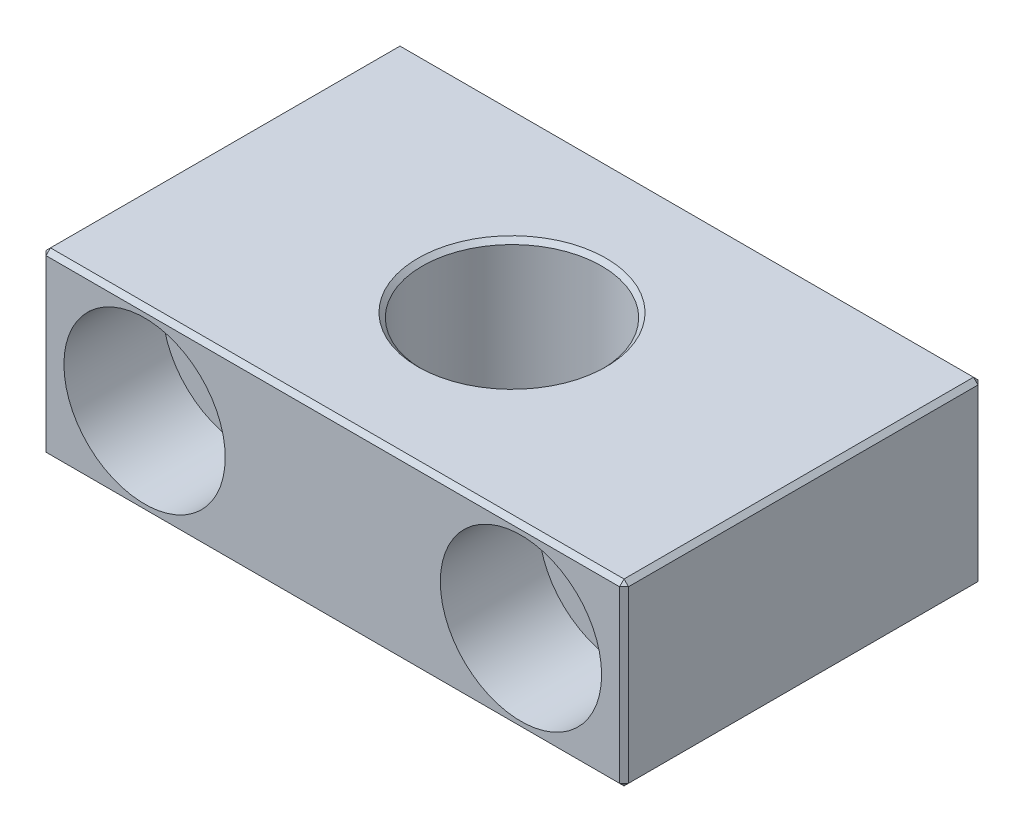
ISO-10303-21;
HEADER;
FILE_DESCRIPTION(('STEP AP214'),'2;1');
FILE_NAME('part.step','',(''),(''),'','','');
FILE_SCHEMA(('AUTOMOTIVE_DESIGN { 1 0 10303 214 1 1 1 1 }'));
ENDSEC;
DATA;
#1=APPLICATION_CONTEXT('core data for automotive mechanical design processes');
#2=APPLICATION_PROTOCOL_DEFINITION('international standard','automotive_design',2000,#1);
#3=PRODUCT_CONTEXT('',#1,'mechanical');
#4=PRODUCT('Part','Part','',(#3));
#5=PRODUCT_RELATED_PRODUCT_CATEGORY('part','',(#4));
#6=PRODUCT_DEFINITION_FORMATION('','',#4);
#7=PRODUCT_DEFINITION_CONTEXT('part definition',#1,'design');
#8=PRODUCT_DEFINITION('design','',#6,#7);
#9=PRODUCT_DEFINITION_SHAPE('','',#8);
#10=(LENGTH_UNIT() NAMED_UNIT(*) SI_UNIT(.MILLI.,.METRE.));
#11=(NAMED_UNIT(*) PLANE_ANGLE_UNIT() SI_UNIT($,.RADIAN.));
#12=(NAMED_UNIT(*) SI_UNIT($,.STERADIAN.) SOLID_ANGLE_UNIT());
#13=UNCERTAINTY_MEASURE_WITH_UNIT(LENGTH_MEASURE(1.E-05),#10,'distance_accuracy_value','');
#14=(GEOMETRIC_REPRESENTATION_CONTEXT(3) GLOBAL_UNCERTAINTY_ASSIGNED_CONTEXT((#13)) GLOBAL_UNIT_ASSIGNED_CONTEXT((#10,
#11,#12)) REPRESENTATION_CONTEXT('',''));
#15=CARTESIAN_POINT('',(0.,0.,0.));
#16=DIRECTION('',(0.,0.,1.));
#17=DIRECTION('',(1.,0.,0.));
#18=AXIS2_PLACEMENT_3D('',#15,#16,#17);
#19=CARTESIAN_POINT('',(32.5,10.0000000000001,40.0000000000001));
#20=DIRECTION('',(-1.,0.,0.));
#21=DIRECTION('',(0.,-1.,0.));
#22=AXIS2_PLACEMENT_3D('',#19,#20,#21);
#23=PLANE('',#22);
#24=DIRECTION('',(0.,0.,1.));
#25=VECTOR('',#24,1.);
#26=CARTESIAN_POINT('',(32.5,9.50000000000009,40.0000000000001));
#27=LINE('',#26,#25);
#28=CARTESIAN_POINT('',(32.5,9.50000000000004,0.500000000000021));
#29=VERTEX_POINT('',#28);
#30=CARTESIAN_POINT('',(32.5,9.50000000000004,39.5000000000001));
#31=VERTEX_POINT('',#30);
#32=EDGE_CURVE('E196',#29,#31,#27,.T.);
#33=ORIENTED_EDGE('',*,*,#32,.T.);
#34=DIRECTION('',(0.,-1.,0.));
#35=VECTOR('',#34,1.);
#36=CARTESIAN_POINT('',(32.5,-9.99999999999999,39.5000000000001));
#37=LINE('',#36,#35);
#38=CARTESIAN_POINT('',(32.5,-9.49999999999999,39.5000000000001));
#39=VERTEX_POINT('',#38);
#40=EDGE_CURVE('E198',#31,#39,#37,.T.);
#41=ORIENTED_EDGE('',*,*,#40,.T.);
#42=DIRECTION('',(0.,0.,-1.));
#43=VECTOR('',#42,1.);
#44=CARTESIAN_POINT('',(32.5,-9.50000000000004,40.0000000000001));
#45=LINE('',#44,#43);
#46=CARTESIAN_POINT('',(32.5,-9.5,0.5));
#47=VERTEX_POINT('',#46);
#48=EDGE_CURVE('E192',#39,#47,#45,.T.);
#49=ORIENTED_EDGE('',*,*,#48,.T.);
#50=DIRECTION('',(0.,1.,0.));
#51=VECTOR('',#50,1.);
#52=CARTESIAN_POINT('',(32.5,10.,0.500000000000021));
#53=LINE('',#52,#51);
#54=EDGE_CURVE('E194',#47,#29,#53,.T.);
#55=ORIENTED_EDGE('',*,*,#54,.T.);
#56=EDGE_LOOP('',(#33,#41,#49,#55));
#57=FACE_BOUND('',#56,.T.);
#58=ADVANCED_FACE('F38',(#57),#23,.F.);
#59=CARTESIAN_POINT('',(-32.5,10.,40.0000000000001));
#60=DIRECTION('',(0.,-1.,0.));
#61=DIRECTION('',(0.,0.,-1.));
#62=AXIS2_PLACEMENT_3D('',#59,#60,#61);
#63=PLANE('',#62);
#64=CARTESIAN_POINT('',(0.,10.,20.));
#65=DIRECTION('',(0.,-1.,0.));
#66=DIRECTION('',(0.,0.,-1.));
#67=AXIS2_PLACEMENT_3D('',#64,#65,#66);
#68=CIRCLE('',#67,10.5);
#69=CARTESIAN_POINT('',(0.,10.,9.49999999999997));
#70=VERTEX_POINT('',#69);
#71=EDGE_CURVE('E173',#70,#70,#68,.T.);
#72=ORIENTED_EDGE('',*,*,#71,.T.);
#73=EDGE_LOOP('',(#72));
#74=FACE_BOUND('',#73,.T.);
#75=DIRECTION('',(1.,0.,0.));
#76=VECTOR('',#75,1.);
#77=CARTESIAN_POINT('',(32.5,10.,39.5000000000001));
#78=LINE('',#77,#76);
#79=CARTESIAN_POINT('',(-32.,10.,39.5000000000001));
#80=VERTEX_POINT('',#79);
#81=CARTESIAN_POINT('',(32.,10.,39.5000000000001));
#82=VERTEX_POINT('',#81);
#83=EDGE_CURVE('E137',#80,#82,#78,.T.);
#84=ORIENTED_EDGE('',*,*,#83,.T.);
#85=DIRECTION('',(0.,0.,-1.));
#86=VECTOR('',#85,1.);
#87=CARTESIAN_POINT('',(32.,10.0000000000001,40.0000000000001));
#88=LINE('',#87,#86);
#89=CARTESIAN_POINT('',(32.,10.,0.5));
#90=VERTEX_POINT('',#89);
#91=EDGE_CURVE('E133',#82,#90,#88,.T.);
#92=ORIENTED_EDGE('',*,*,#91,.T.);
#93=DIRECTION('',(-1.,0.,0.));
#94=VECTOR('',#93,1.);
#95=CARTESIAN_POINT('',(-32.5,10.,0.500000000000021));
#96=LINE('',#95,#94);
#97=CARTESIAN_POINT('',(-32.,10.,0.49999999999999));
#98=VERTEX_POINT('',#97);
#99=EDGE_CURVE('E125',#90,#98,#96,.T.);
#100=ORIENTED_EDGE('',*,*,#99,.T.);
#101=DIRECTION('',(0.,0.,1.));
#102=VECTOR('',#101,1.);
#103=CARTESIAN_POINT('',(-32.,10.,40.0000000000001));
#104=LINE('',#103,#102);
#105=EDGE_CURVE('E130',#98,#80,#104,.T.);
#106=ORIENTED_EDGE('',*,*,#105,.T.);
#107=EDGE_LOOP('',(#84,#92,#100,#106));
#108=FACE_BOUND('',#107,.T.);
#109=ADVANCED_FACE('F128',(#74,#108),#63,.F.);
#110=CARTESIAN_POINT('',(-32.5,10.,40.0000000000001));
#111=DIRECTION('',(1.,0.,0.));
#112=DIRECTION('',(0.,1.,0.));
#113=AXIS2_PLACEMENT_3D('',#110,#111,#112);
#114=PLANE('',#113);
#115=DIRECTION('',(0.,1.,0.));
#116=VECTOR('',#115,1.);
#117=CARTESIAN_POINT('',(-32.5,10.,39.5000000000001));
#118=LINE('',#117,#116);
#119=CARTESIAN_POINT('',(-32.5,-9.5,39.5000000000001));
#120=VERTEX_POINT('',#119);
#121=CARTESIAN_POINT('',(-32.5,9.50000000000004,39.5000000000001));
#122=VERTEX_POINT('',#121);
#123=EDGE_CURVE('E205',#120,#122,#118,.T.);
#124=ORIENTED_EDGE('',*,*,#123,.T.);
#125=DIRECTION('',(0.,0.,-1.));
#126=VECTOR('',#125,1.);
#127=CARTESIAN_POINT('',(-32.5,9.50000000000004,40.0000000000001));
#128=LINE('',#127,#126);
#129=CARTESIAN_POINT('',(-32.5,9.5,0.500000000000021));
#130=VERTEX_POINT('',#129);
#131=EDGE_CURVE('E207',#122,#130,#128,.T.);
#132=ORIENTED_EDGE('',*,*,#131,.T.);
#133=DIRECTION('',(0.,-1.,0.));
#134=VECTOR('',#133,1.);
#135=CARTESIAN_POINT('',(-32.5,10.,0.500000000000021));
#136=LINE('',#135,#134);
#137=CARTESIAN_POINT('',(-32.5,-9.50000000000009,0.5));
#138=VERTEX_POINT('',#137);
#139=EDGE_CURVE('E203',#130,#138,#136,.T.);
#140=ORIENTED_EDGE('',*,*,#139,.T.);
#141=DIRECTION('',(0.,0.,1.));
#142=VECTOR('',#141,1.);
#143=CARTESIAN_POINT('',(-32.5,-9.50000000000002,40.0000000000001));
#144=LINE('',#143,#142);
#145=EDGE_CURVE('E201',#138,#120,#144,.T.);
#146=ORIENTED_EDGE('',*,*,#145,.T.);
#147=EDGE_LOOP('',(#124,#132,#140,#146));
#148=FACE_BOUND('',#147,.T.);
#149=ADVANCED_FACE('F314',(#148),#114,.F.);
#150=CARTESIAN_POINT('',(-32.5,-10.,40.0000000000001));
#151=DIRECTION('',(0.,1.,0.));
#152=DIRECTION('',(0.,0.,1.));
#153=AXIS2_PLACEMENT_3D('',#150,#151,#152);
#154=PLANE('',#153);
#155=DIRECTION('',(-1.,0.,0.));
#156=VECTOR('',#155,1.);
#157=CARTESIAN_POINT('',(-32.5,-10.,39.5000000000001));
#158=LINE('',#157,#156);
#159=CARTESIAN_POINT('',(32.,-9.99999999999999,39.5000000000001));
#160=VERTEX_POINT('',#159);
#161=CARTESIAN_POINT('',(-32.,-10.,39.5000000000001));
#162=VERTEX_POINT('',#161);
#163=EDGE_CURVE('E47',#160,#162,#158,.T.);
#164=ORIENTED_EDGE('',*,*,#163,.T.);
#165=DIRECTION('',(0.,0.,-1.));
#166=VECTOR('',#165,1.);
#167=CARTESIAN_POINT('',(-32.,-10.,40.0000000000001));
#168=LINE('',#167,#166);
#169=CARTESIAN_POINT('',(-32.,-10.0000000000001,0.49999999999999));
#170=VERTEX_POINT('',#169);
#171=EDGE_CURVE('E11',#162,#170,#168,.T.);
#172=ORIENTED_EDGE('',*,*,#171,.T.);
#173=DIRECTION('',(1.,0.,0.));
#174=VECTOR('',#173,1.);
#175=CARTESIAN_POINT('',(-32.5,-10.0000000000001,0.500000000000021));
#176=LINE('',#175,#174);
#177=CARTESIAN_POINT('',(32.,-10.,0.5));
#178=VERTEX_POINT('',#177);
#179=EDGE_CURVE('E213',#170,#178,#176,.T.);
#180=ORIENTED_EDGE('',*,*,#179,.T.);
#181=DIRECTION('',(0.,0.,1.));
#182=VECTOR('',#181,1.);
#183=CARTESIAN_POINT('',(32.,-10.,40.0000000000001));
#184=LINE('',#183,#182);
#185=EDGE_CURVE('E58',#178,#160,#184,.T.);
#186=ORIENTED_EDGE('',*,*,#185,.T.);
#187=EDGE_LOOP('',(#164,#172,#180,#186));
#188=FACE_BOUND('',#187,.T.);
#189=CARTESIAN_POINT('',(0.,-9.99999999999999,20.));
#190=DIRECTION('',(0.,1.,0.));
#191=DIRECTION('',(0.,0.,1.));
#192=AXIS2_PLACEMENT_3D('',#189,#190,#191);
#193=CIRCLE('',#192,10.5);
#194=CARTESIAN_POINT('',(0.,-9.99999999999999,30.5000000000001));
#195=VERTEX_POINT('',#194);
#196=EDGE_CURVE('E210',#195,#195,#193,.T.);
#197=ORIENTED_EDGE('',*,*,#196,.T.);
#198=EDGE_LOOP('',(#197));
#199=FACE_BOUND('',#198,.T.);
#200=ADVANCED_FACE('F311',(#188,#199),#154,.F.);
#201=CARTESIAN_POINT('',(32.5,-10.,40.0000000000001));
#202=DIRECTION('',(0.,0.,1.));
#203=DIRECTION('',(1.,0.,0.));
#204=AXIS2_PLACEMENT_3D('',#201,#202,#203);
#205=PLANE('',#204);
#206=DIRECTION('',(0.,1.,0.));
#207=VECTOR('',#206,1.);
#208=CARTESIAN_POINT('',(32.,10.0000000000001,40.0000000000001));
#209=LINE('',#208,#207);
#210=CARTESIAN_POINT('',(32.,-9.50000000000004,40.0000000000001));
#211=VERTEX_POINT('',#210);
#212=CARTESIAN_POINT('',(32.,9.50000000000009,40.0000000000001));
#213=VERTEX_POINT('',#212);
#214=EDGE_CURVE('E180',#211,#213,#209,.T.);
#215=ORIENTED_EDGE('',*,*,#214,.T.);
#216=DIRECTION('',(-1.,0.,0.));
#217=VECTOR('',#216,1.);
#218=CARTESIAN_POINT('',(-32.5,9.50000000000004,40.0000000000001));
#219=LINE('',#218,#217);
#220=CARTESIAN_POINT('',(-32.,9.50000000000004,40.0000000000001));
#221=VERTEX_POINT('',#220);
#222=EDGE_CURVE('E182',#213,#221,#219,.T.);
#223=ORIENTED_EDGE('',*,*,#222,.T.);
#224=DIRECTION('',(0.,-1.,0.));
#225=VECTOR('',#224,1.);
#226=CARTESIAN_POINT('',(-32.,-10.,40.0000000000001));
#227=LINE('',#226,#225);
#228=CARTESIAN_POINT('',(-32.,-9.50000000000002,40.0000000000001));
#229=VERTEX_POINT('',#228);
#230=EDGE_CURVE('E178',#221,#229,#227,.T.);
#231=ORIENTED_EDGE('',*,*,#230,.T.);
#232=DIRECTION('',(1.,0.,0.));
#233=VECTOR('',#232,1.);
#234=CARTESIAN_POINT('',(32.5,-9.50000000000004,40.0000000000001));
#235=LINE('',#234,#233);
#236=EDGE_CURVE('E176',#229,#211,#235,.T.);
#237=ORIENTED_EDGE('',*,*,#236,.T.);
#238=EDGE_LOOP('',(#215,#223,#231,#237));
#239=FACE_BOUND('',#238,.T.);
#240=CARTESIAN_POINT('',(-21.,-0.0100000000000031,40.0000000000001));
#241=DIRECTION('',(0.,0.,1.));
#242=DIRECTION('',(1.,0.,0.));
#243=AXIS2_PLACEMENT_3D('',#240,#241,#242);
#244=CIRCLE('',#243,9.);
#245=CARTESIAN_POINT('',(-12.,-0.0100000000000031,40.0000000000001));
#246=VERTEX_POINT('',#245);
#247=EDGE_CURVE('E271',#246,#246,#244,.T.);
#248=ORIENTED_EDGE('',*,*,#247,.F.);
#249=EDGE_LOOP('',(#248));
#250=FACE_BOUND('',#249,.T.);
#251=CARTESIAN_POINT('',(21.,-0.0100000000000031,40.0000000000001));
#252=DIRECTION('',(0.,0.,1.));
#253=DIRECTION('',(1.,0.,0.));
#254=AXIS2_PLACEMENT_3D('',#251,#252,#253);
#255=CIRCLE('',#254,9.);
#256=CARTESIAN_POINT('',(30.,-0.0100000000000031,40.0000000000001));
#257=VERTEX_POINT('',#256);
#258=EDGE_CURVE('E287',#257,#257,#255,.T.);
#259=ORIENTED_EDGE('',*,*,#258,.F.);
#260=EDGE_LOOP('',(#259));
#261=FACE_BOUND('',#260,.T.);
#262=ADVANCED_FACE('F313',(#239,#250,#261),#205,.T.);
#263=CARTESIAN_POINT('',(32.5,-10.,0.));
#264=DIRECTION('',(0.,0.,1.));
#265=DIRECTION('',(1.,0.,0.));
#266=AXIS2_PLACEMENT_3D('',#263,#264,#265);
#267=PLANE('',#266);
#268=DIRECTION('',(0.,1.,0.));
#269=VECTOR('',#268,1.);
#270=CARTESIAN_POINT('',(-32.,-9.99999999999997,0.));
#271=LINE('',#270,#269);
#272=CARTESIAN_POINT('',(-32.,-9.49999999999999,0.));
#273=VERTEX_POINT('',#272);
#274=CARTESIAN_POINT('',(-32.,9.50000000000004,0.));
#275=VERTEX_POINT('',#274);
#276=EDGE_CURVE('E187',#273,#275,#271,.T.);
#277=ORIENTED_EDGE('',*,*,#276,.T.);
#278=DIRECTION('',(1.,0.,0.));
#279=VECTOR('',#278,1.);
#280=CARTESIAN_POINT('',(32.5,9.50000000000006,0.));
#281=LINE('',#280,#279);
#282=CARTESIAN_POINT('',(32.,9.50000000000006,0.));
#283=VERTEX_POINT('',#282);
#284=EDGE_CURVE('E145',#275,#283,#281,.T.);
#285=ORIENTED_EDGE('',*,*,#284,.T.);
#286=DIRECTION('',(0.,-1.,0.));
#287=VECTOR('',#286,1.);
#288=CARTESIAN_POINT('',(32.,-10.,0.));
#289=LINE('',#288,#287);
#290=CARTESIAN_POINT('',(32.,-9.5,0.));
#291=VERTEX_POINT('',#290);
#292=EDGE_CURVE('E189',#283,#291,#289,.T.);
#293=ORIENTED_EDGE('',*,*,#292,.T.);
#294=DIRECTION('',(-1.,0.,0.));
#295=VECTOR('',#294,1.);
#296=CARTESIAN_POINT('',(32.5,-9.5,0.));
#297=LINE('',#296,#295);
#298=EDGE_CURVE('E185',#291,#273,#297,.T.);
#299=ORIENTED_EDGE('',*,*,#298,.T.);
#300=EDGE_LOOP('',(#277,#285,#293,#299));
#301=FACE_BOUND('',#300,.T.);
#302=CARTESIAN_POINT('',(21.,-0.0100000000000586,0.));
#303=DIRECTION('',(0.,0.,1.));
#304=DIRECTION('',(1.,0.,0.));
#305=AXIS2_PLACEMENT_3D('',#302,#303,#304);
#306=CIRCLE('',#305,5.5);
#307=CARTESIAN_POINT('',(26.5,-0.0100000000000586,0.));
#308=VERTEX_POINT('',#307);
#309=EDGE_CURVE('E296',#308,#308,#306,.T.);
#310=ORIENTED_EDGE('',*,*,#309,.T.);
#311=EDGE_LOOP('',(#310));
#312=FACE_BOUND('',#311,.T.);
#313=CARTESIAN_POINT('',(-21.,-0.0100000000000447,0.));
#314=DIRECTION('',(0.,0.,1.));
#315=DIRECTION('',(1.,0.,0.));
#316=AXIS2_PLACEMENT_3D('',#313,#314,#315);
#317=CIRCLE('',#316,5.5);
#318=CARTESIAN_POINT('',(-15.5,-0.0100000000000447,0.));
#319=VERTEX_POINT('',#318);
#320=EDGE_CURVE('E299',#319,#319,#317,.T.);
#321=ORIENTED_EDGE('',*,*,#320,.T.);
#322=EDGE_LOOP('',(#321));
#323=FACE_BOUND('',#322,.T.);
#324=ADVANCED_FACE('F320',(#301,#312,#323),#267,.F.);
#325=CARTESIAN_POINT('',(-21.,-0.0100000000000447,0.));
#326=DIRECTION('',(0.,0.,1.));
#327=DIRECTION('',(1.,0.,0.));
#328=AXIS2_PLACEMENT_3D('',#325,#326,#327);
#329=CYLINDRICAL_SURFACE('',#328,5.5);
#330=CARTESIAN_POINT('',(-21.,-0.00999999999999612,29.0000000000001));
#331=DIRECTION('',(0.,0.,1.));
#332=DIRECTION('',(1.,0.,0.));
#333=AXIS2_PLACEMENT_3D('',#330,#331,#332);
#334=CIRCLE('',#333,5.5);
#335=CARTESIAN_POINT('',(-15.5,-0.00999999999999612,29.0000000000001));
#336=VERTEX_POINT('',#335);
#337=EDGE_CURVE('E282',#336,#336,#334,.T.);
#338=ORIENTED_EDGE('',*,*,#337,.T.);
#339=EDGE_LOOP('',(#338));
#340=FACE_BOUND('',#339,.T.);
#341=ORIENTED_EDGE('',*,*,#320,.F.);
#342=EDGE_LOOP('',(#341));
#343=FACE_BOUND('',#342,.T.);
#344=ADVANCED_FACE('F466',(#340,#343),#329,.F.);
#345=CARTESIAN_POINT('',(21.,-0.0100000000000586,0.));
#346=DIRECTION('',(0.,0.,1.));
#347=DIRECTION('',(1.,0.,0.));
#348=AXIS2_PLACEMENT_3D('',#345,#346,#347);
#349=CYLINDRICAL_SURFACE('',#348,5.5);
#350=CARTESIAN_POINT('',(21.,-0.00999999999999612,29.0000000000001));
#351=DIRECTION('',(0.,0.,1.));
#352=DIRECTION('',(1.,0.,0.));
#353=AXIS2_PLACEMENT_3D('',#350,#351,#352);
#354=CIRCLE('',#353,5.5);
#355=CARTESIAN_POINT('',(26.5,-0.00999999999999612,29.0000000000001));
#356=VERTEX_POINT('',#355);
#357=EDGE_CURVE('E293',#356,#356,#354,.T.);
#358=ORIENTED_EDGE('',*,*,#357,.T.);
#359=EDGE_LOOP('',(#358));
#360=FACE_BOUND('',#359,.T.);
#361=ORIENTED_EDGE('',*,*,#309,.F.);
#362=EDGE_LOOP('',(#361));
#363=FACE_BOUND('',#362,.T.);
#364=ADVANCED_FACE('F462',(#360,#363),#349,.F.);
#365=CARTESIAN_POINT('',(0.,-11.,20.));
#366=DIRECTION('',(0.,1.,0.));
#367=DIRECTION('',(0.,0.,1.));
#368=AXIS2_PLACEMENT_3D('',#365,#366,#367);
#369=CYLINDRICAL_SURFACE('',#368,10.);
#370=CARTESIAN_POINT('',(0.,9.5,20.));
#371=DIRECTION('',(0.,-1.,0.));
#372=DIRECTION('',(0.,0.,-1.));
#373=AXIS2_PLACEMENT_3D('',#370,#371,#372);
#374=CIRCLE('',#373,10.);
#375=CARTESIAN_POINT('',(0.,9.5,9.99999999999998));
#376=VERTEX_POINT('',#375);
#377=EDGE_CURVE('E164',#376,#376,#374,.F.);
#378=ORIENTED_EDGE('',*,*,#377,.T.);
#379=EDGE_LOOP('',(#378));
#380=FACE_BOUND('',#379,.T.);
#381=CARTESIAN_POINT('',(0.,-9.49999999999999,20.));
#382=DIRECTION('',(0.,1.,0.));
#383=DIRECTION('',(0.,0.,1.));
#384=AXIS2_PLACEMENT_3D('',#381,#382,#383);
#385=CIRCLE('',#384,10.);
#386=CARTESIAN_POINT('',(0.,-9.49999999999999,30.0000000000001));
#387=VERTEX_POINT('',#386);
#388=EDGE_CURVE('E167',#387,#387,#385,.F.);
#389=ORIENTED_EDGE('',*,*,#388,.T.);
#390=EDGE_LOOP('',(#389));
#391=FACE_BOUND('',#390,.T.);
#392=ADVANCED_FACE('F304',(#380,#391),#369,.F.);
#393=CARTESIAN_POINT('',(26.5,-0.00999999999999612,29.0000000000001));
#394=DIRECTION('',(0.,0.,-1.));
#395=DIRECTION('',(-1.,0.,0.));
#396=AXIS2_PLACEMENT_3D('',#393,#394,#395);
#397=PLANE('',#396);
#398=ORIENTED_EDGE('',*,*,#357,.F.);
#399=EDGE_LOOP('',(#398));
#400=FACE_BOUND('',#399,.T.);
#401=CARTESIAN_POINT('',(21.,-0.00999999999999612,29.0000000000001));
#402=DIRECTION('',(0.,0.,1.));
#403=DIRECTION('',(1.,0.,0.));
#404=AXIS2_PLACEMENT_3D('',#401,#402,#403);
#405=CIRCLE('',#404,9.);
#406=CARTESIAN_POINT('',(30.,-0.00999999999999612,29.0000000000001));
#407=VERTEX_POINT('',#406);
#408=EDGE_CURVE('E290',#407,#407,#405,.T.);
#409=ORIENTED_EDGE('',*,*,#408,.T.);
#410=EDGE_LOOP('',(#409));
#411=FACE_BOUND('',#410,.T.);
#412=ADVANCED_FACE('F446',(#400,#411),#397,.F.);
#413=CARTESIAN_POINT('',(21.,-0.0100000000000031,40.0000000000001));
#414=DIRECTION('',(0.,0.,1.));
#415=DIRECTION('',(1.,0.,0.));
#416=AXIS2_PLACEMENT_3D('',#413,#414,#415);
#417=CYLINDRICAL_SURFACE('',#416,9.);
#418=ORIENTED_EDGE('',*,*,#408,.F.);
#419=EDGE_LOOP('',(#418));
#420=FACE_BOUND('',#419,.T.);
#421=ORIENTED_EDGE('',*,*,#258,.T.);
#422=EDGE_LOOP('',(#421));
#423=FACE_BOUND('',#422,.T.);
#424=ADVANCED_FACE('F443',(#420,#423),#417,.F.);
#425=CARTESIAN_POINT('',(-15.5,-0.00999999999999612,29.0000000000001));
#426=DIRECTION('',(0.,0.,-1.));
#427=DIRECTION('',(-1.,0.,0.));
#428=AXIS2_PLACEMENT_3D('',#425,#426,#427);
#429=PLANE('',#428);
#430=ORIENTED_EDGE('',*,*,#337,.F.);
#431=EDGE_LOOP('',(#430));
#432=FACE_BOUND('',#431,.T.);
#433=CARTESIAN_POINT('',(-21.,-0.00999999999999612,29.0000000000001));
#434=DIRECTION('',(0.,0.,1.));
#435=DIRECTION('',(1.,0.,0.));
#436=AXIS2_PLACEMENT_3D('',#433,#434,#435);
#437=CIRCLE('',#436,9.);
#438=CARTESIAN_POINT('',(-12.,-0.00999999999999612,29.0000000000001));
#439=VERTEX_POINT('',#438);
#440=EDGE_CURVE('E277',#439,#439,#437,.T.);
#441=ORIENTED_EDGE('',*,*,#440,.T.);
#442=EDGE_LOOP('',(#441));
#443=FACE_BOUND('',#442,.T.);
#444=ADVANCED_FACE('F445',(#432,#443),#429,.F.);
#445=CARTESIAN_POINT('',(-21.,-0.0100000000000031,40.0000000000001));
#446=DIRECTION('',(0.,0.,1.));
#447=DIRECTION('',(1.,0.,0.));
#448=AXIS2_PLACEMENT_3D('',#445,#446,#447);
#449=CYLINDRICAL_SURFACE('',#448,9.);
#450=ORIENTED_EDGE('',*,*,#440,.F.);
#451=EDGE_LOOP('',(#450));
#452=FACE_BOUND('',#451,.T.);
#453=ORIENTED_EDGE('',*,*,#247,.T.);
#454=EDGE_LOOP('',(#453));
#455=FACE_BOUND('',#454,.T.);
#456=ADVANCED_FACE('F339',(#452,#455),#449,.F.);
#457=CARTESIAN_POINT('',(0.,9.5,20.));
#458=DIRECTION('',(0.,1.,0.));
#459=DIRECTION('',(0.,0.,1.));
#460=AXIS2_PLACEMENT_3D('',#457,#458,#459);
#461=CONICAL_SURFACE('',#460,10.,0.78539816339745);
#462=ORIENTED_EDGE('',*,*,#71,.F.);
#463=EDGE_LOOP('',(#462));
#464=FACE_BOUND('',#463,.T.);
#465=ORIENTED_EDGE('',*,*,#377,.F.);
#466=EDGE_LOOP('',(#465));
#467=FACE_BOUND('',#466,.T.);
#468=ADVANCED_FACE('F335',(#464,#467),#461,.F.);
#469=CARTESIAN_POINT('',(-32.5,-10.0000000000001,0.500000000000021));
#470=DIRECTION('',(0.,0.707106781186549,0.707106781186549));
#471=DIRECTION('',(1.,0.,0.));
#472=AXIS2_PLACEMENT_3D('',#469,#470,#471);
#473=PLANE('',#472);
#474=DIRECTION('',(0.,-0.707106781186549,0.707106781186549));
#475=VECTOR('',#474,1.);
#476=CARTESIAN_POINT('',(32.,-9.5,0.));
#477=LINE('',#476,#475);
#478=EDGE_CURVE('E42',#178,#291,#477,.F.);
#479=ORIENTED_EDGE('',*,*,#478,.F.);
#480=ORIENTED_EDGE('',*,*,#179,.F.);
#481=DIRECTION('',(0.,0.707106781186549,-0.707106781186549));
#482=VECTOR('',#481,1.);
#483=CARTESIAN_POINT('',(-32.,-9.75000000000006,0.24999999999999));
#484=LINE('',#483,#482);
#485=EDGE_CURVE('E263',#273,#170,#484,.F.);
#486=ORIENTED_EDGE('',*,*,#485,.F.);
#487=ORIENTED_EDGE('',*,*,#298,.F.);
#488=EDGE_LOOP('',(#479,#480,#486,#487));
#489=FACE_BOUND('',#488,.T.);
#490=ADVANCED_FACE('F338',(#489),#473,.F.);
#491=CARTESIAN_POINT('',(32.,-9.5,0.));
#492=DIRECTION('',(0.577350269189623,-0.577350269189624,-0.577350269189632));
#493=DIRECTION('',(-0.707106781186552,0.,-0.707106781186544));
#494=AXIS2_PLACEMENT_3D('',#491,#492,#493);
#495=PLANE('',#494);
#496=DIRECTION('',(0.707106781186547,0.707106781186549,0.));
#497=VECTOR('',#496,1.);
#498=CARTESIAN_POINT('',(32.25,-9.75,0.500000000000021));
#499=LINE('',#498,#497);
#500=EDGE_CURVE('E258',#178,#47,#499,.T.);
#501=ORIENTED_EDGE('',*,*,#500,.F.);
#502=ORIENTED_EDGE('',*,*,#478,.T.);
#503=DIRECTION('',(-0.707106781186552,0.,-0.707106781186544));
#504=VECTOR('',#503,1.);
#505=CARTESIAN_POINT('',(32.,-9.5,0.));
#506=LINE('',#505,#504);
#507=EDGE_CURVE('E261',#47,#291,#506,.T.);
#508=ORIENTED_EDGE('',*,*,#507,.F.);
#509=EDGE_LOOP('',(#501,#502,#508));
#510=FACE_BOUND('',#509,.T.);
#511=ADVANCED_FACE('F405',(#510),#495,.T.);
#512=CARTESIAN_POINT('',(-32.5,-9.50000000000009,0.5));
#513=DIRECTION('',(-0.577350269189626,-0.577350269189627,-0.577350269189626));
#514=DIRECTION('',(-0.707106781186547,0.,0.707106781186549));
#515=AXIS2_PLACEMENT_3D('',#512,#513,#514);
#516=PLANE('',#515);
#517=DIRECTION('',(-0.707106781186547,0.,0.707106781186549));
#518=VECTOR('',#517,1.);
#519=CARTESIAN_POINT('',(-32.5,-9.50000000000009,0.5));
#520=LINE('',#519,#518);
#521=EDGE_CURVE('E253',#273,#138,#520,.T.);
#522=ORIENTED_EDGE('',*,*,#521,.F.);
#523=ORIENTED_EDGE('',*,*,#485,.T.);
#524=DIRECTION('',(0.707106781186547,-0.707106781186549,0.));
#525=VECTOR('',#524,1.);
#526=CARTESIAN_POINT('',(-32.5,-9.50000000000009,0.5));
#527=LINE('',#526,#525);
#528=EDGE_CURVE('E256',#138,#170,#527,.T.);
#529=ORIENTED_EDGE('',*,*,#528,.F.);
#530=EDGE_LOOP('',(#522,#523,#529));
#531=FACE_BOUND('',#530,.T.);
#532=ADVANCED_FACE('F401',(#531),#516,.T.);
#533=CARTESIAN_POINT('',(32.5,10.,0.500000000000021));
#534=DIRECTION('',(-0.707106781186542,0.,0.707106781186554));
#535=DIRECTION('',(0.,1.,0.));
#536=AXIS2_PLACEMENT_3D('',#533,#534,#535);
#537=PLANE('',#536);
#538=ORIENTED_EDGE('',*,*,#507,.T.);
#539=ORIENTED_EDGE('',*,*,#292,.F.);
#540=DIRECTION('',(0.707106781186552,0.,0.707106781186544));
#541=VECTOR('',#540,1.);
#542=CARTESIAN_POINT('',(32.,9.50000000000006,0.));
#543=LINE('',#542,#541);
#544=EDGE_CURVE('E249',#29,#283,#543,.F.);
#545=ORIENTED_EDGE('',*,*,#544,.F.);
#546=ORIENTED_EDGE('',*,*,#54,.F.);
#547=EDGE_LOOP('',(#538,#539,#545,#546));
#548=FACE_BOUND('',#547,.T.);
#549=ADVANCED_FACE('F397',(#548),#537,.F.);
#550=CARTESIAN_POINT('',(32.5,-9.50000000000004,40.0000000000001));
#551=DIRECTION('',(-0.707106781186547,0.707106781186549,0.));
#552=DIRECTION('',(0.,0.,-1.));
#553=AXIS2_PLACEMENT_3D('',#550,#551,#552);
#554=PLANE('',#553);
#555=ORIENTED_EDGE('',*,*,#500,.T.);
#556=ORIENTED_EDGE('',*,*,#48,.F.);
#557=DIRECTION('',(-0.707106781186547,-0.707106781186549,0.));
#558=VECTOR('',#557,1.);
#559=CARTESIAN_POINT('',(32.5,-9.49999999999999,39.5000000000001));
#560=LINE('',#559,#558);
#561=EDGE_CURVE('E246',#160,#39,#560,.F.);
#562=ORIENTED_EDGE('',*,*,#561,.F.);
#563=ORIENTED_EDGE('',*,*,#185,.F.);
#564=EDGE_LOOP('',(#555,#556,#562,#563));
#565=FACE_BOUND('',#564,.T.);
#566=ADVANCED_FACE('F393',(#565),#554,.F.);
#567=CARTESIAN_POINT('',(32.5,-9.50000000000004,40.0000000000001));
#568=DIRECTION('',(0.,-0.707106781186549,0.707106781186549));
#569=DIRECTION('',(-1.,0.,0.));
#570=AXIS2_PLACEMENT_3D('',#567,#568,#569);
#571=PLANE('',#570);
#572=DIRECTION('',(0.,0.707106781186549,0.707106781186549));
#573=VECTOR('',#572,1.);
#574=CARTESIAN_POINT('',(-32.,-9.50000000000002,40.0000000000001));
#575=LINE('',#574,#573);
#576=EDGE_CURVE('E240',#162,#229,#575,.T.);
#577=ORIENTED_EDGE('',*,*,#576,.F.);
#578=ORIENTED_EDGE('',*,*,#163,.F.);
#579=DIRECTION('',(0.,-0.707106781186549,-0.707106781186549));
#580=VECTOR('',#579,1.);
#581=CARTESIAN_POINT('',(32.,-9.75000000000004,39.7500000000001));
#582=LINE('',#581,#580);
#583=EDGE_CURVE('E243',#211,#160,#582,.T.);
#584=ORIENTED_EDGE('',*,*,#583,.F.);
#585=ORIENTED_EDGE('',*,*,#236,.F.);
#586=EDGE_LOOP('',(#577,#578,#584,#585));
#587=FACE_BOUND('',#586,.T.);
#588=ADVANCED_FACE('F389',(#587),#571,.T.);
#589=CARTESIAN_POINT('',(-32.,-10.,40.0000000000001));
#590=DIRECTION('',(0.707106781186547,0.707106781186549,0.));
#591=DIRECTION('',(0.,0.,-1.));
#592=AXIS2_PLACEMENT_3D('',#589,#590,#591);
#593=PLANE('',#592);
#594=ORIENTED_EDGE('',*,*,#528,.T.);
#595=ORIENTED_EDGE('',*,*,#171,.F.);
#596=DIRECTION('',(-0.707106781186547,0.707106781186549,0.));
#597=VECTOR('',#596,1.);
#598=CARTESIAN_POINT('',(-32.25,-9.75,39.5000000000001));
#599=LINE('',#598,#597);
#600=EDGE_CURVE('E237',#120,#162,#599,.F.);
#601=ORIENTED_EDGE('',*,*,#600,.F.);
#602=ORIENTED_EDGE('',*,*,#145,.F.);
#603=EDGE_LOOP('',(#594,#595,#601,#602));
#604=FACE_BOUND('',#603,.T.);
#605=ADVANCED_FACE('F385',(#604),#593,.F.);
#606=CARTESIAN_POINT('',(-32.5,10.,0.500000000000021));
#607=DIRECTION('',(0.707106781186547,0.,0.707106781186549));
#608=DIRECTION('',(0.,-1.,0.));
#609=AXIS2_PLACEMENT_3D('',#606,#607,#608);
#610=PLANE('',#609);
#611=ORIENTED_EDGE('',*,*,#521,.T.);
#612=ORIENTED_EDGE('',*,*,#139,.F.);
#613=DIRECTION('',(0.707106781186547,0.,-0.707106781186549));
#614=VECTOR('',#613,1.);
#615=CARTESIAN_POINT('',(-32.25,9.50000000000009,0.250000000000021));
#616=LINE('',#615,#614);
#617=EDGE_CURVE('E149',#275,#130,#616,.F.);
#618=ORIENTED_EDGE('',*,*,#617,.F.);
#619=ORIENTED_EDGE('',*,*,#276,.F.);
#620=EDGE_LOOP('',(#611,#612,#618,#619));
#621=FACE_BOUND('',#620,.T.);
#622=ADVANCED_FACE('F382',(#621),#610,.F.);
#623=CARTESIAN_POINT('',(-32.5,10.,0.500000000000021));
#624=DIRECTION('',(0.,-0.707106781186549,0.707106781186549));
#625=DIRECTION('',(-1.,0.,0.));
#626=AXIS2_PLACEMENT_3D('',#623,#624,#625);
#627=PLANE('',#626);
#628=DIRECTION('',(0.,-0.707106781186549,-0.707106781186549));
#629=VECTOR('',#628,1.);
#630=CARTESIAN_POINT('',(32.,9.50000000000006,0.));
#631=LINE('',#630,#629);
#632=EDGE_CURVE('E251',#283,#90,#631,.F.);
#633=ORIENTED_EDGE('',*,*,#632,.F.);
#634=ORIENTED_EDGE('',*,*,#284,.F.);
#635=DIRECTION('',(0.,0.707106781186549,0.707106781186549));
#636=VECTOR('',#635,1.);
#637=CARTESIAN_POINT('',(-32.,10.,0.49999999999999));
#638=LINE('',#637,#636);
#639=EDGE_CURVE('E141',#98,#275,#638,.F.);
#640=ORIENTED_EDGE('',*,*,#639,.F.);
#641=ORIENTED_EDGE('',*,*,#99,.F.);
#642=EDGE_LOOP('',(#633,#634,#640,#641));
#643=FACE_BOUND('',#642,.T.);
#644=ADVANCED_FACE('F143',(#643),#627,.F.);
#645=CARTESIAN_POINT('',(32.,9.50000000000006,0.));
#646=DIRECTION('',(0.577350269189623,0.577350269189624,-0.577350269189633));
#647=DIRECTION('',(-0.707106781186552,0.,-0.707106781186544));
#648=AXIS2_PLACEMENT_3D('',#645,#646,#647);
#649=PLANE('',#648);
#650=ORIENTED_EDGE('',*,*,#544,.T.);
#651=ORIENTED_EDGE('',*,*,#632,.T.);
#652=DIRECTION('',(-0.707106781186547,0.707106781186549,0.));
#653=VECTOR('',#652,1.);
#654=CARTESIAN_POINT('',(32.25,9.75000000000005,0.500000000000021));
#655=LINE('',#654,#653);
#656=EDGE_CURVE('E150',#29,#90,#655,.T.);
#657=ORIENTED_EDGE('',*,*,#656,.F.);
#658=EDGE_LOOP('',(#650,#651,#657));
#659=FACE_BOUND('',#658,.T.);
#660=ADVANCED_FACE('F375',(#659),#649,.T.);
#661=CARTESIAN_POINT('',(32.5,-9.49999999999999,39.5000000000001));
#662=DIRECTION('',(0.577350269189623,-0.577350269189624,0.577350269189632));
#663=DIRECTION('',(0.707106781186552,0.,-0.707106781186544));
#664=AXIS2_PLACEMENT_3D('',#661,#662,#663);
#665=PLANE('',#664);
#666=ORIENTED_EDGE('',*,*,#583,.T.);
#667=ORIENTED_EDGE('',*,*,#561,.T.);
#668=DIRECTION('',(-0.707106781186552,0.,0.707106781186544));
#669=VECTOR('',#668,1.);
#670=CARTESIAN_POINT('',(32.5,-9.49999999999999,39.5000000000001));
#671=LINE('',#670,#669);
#672=EDGE_CURVE('E232',#211,#39,#671,.F.);
#673=ORIENTED_EDGE('',*,*,#672,.F.);
#674=EDGE_LOOP('',(#666,#667,#673));
#675=FACE_BOUND('',#674,.T.);
#676=ADVANCED_FACE('F371',(#675),#665,.T.);
#677=CARTESIAN_POINT('',(-32.,-9.50000000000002,40.0000000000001));
#678=DIRECTION('',(-0.577350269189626,-0.577350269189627,0.577350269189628));
#679=DIRECTION('',(0.707106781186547,0.,0.707106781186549));
#680=AXIS2_PLACEMENT_3D('',#677,#678,#679);
#681=PLANE('',#680);
#682=ORIENTED_EDGE('',*,*,#600,.T.);
#683=ORIENTED_EDGE('',*,*,#576,.T.);
#684=DIRECTION('',(-0.707106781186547,0.,-0.707106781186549));
#685=VECTOR('',#684,1.);
#686=CARTESIAN_POINT('',(-32.,-9.50000000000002,40.0000000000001));
#687=LINE('',#686,#685);
#688=EDGE_CURVE('E157',#120,#229,#687,.F.);
#689=ORIENTED_EDGE('',*,*,#688,.F.);
#690=EDGE_LOOP('',(#682,#683,#689));
#691=FACE_BOUND('',#690,.T.);
#692=ADVANCED_FACE('F368',(#691),#681,.T.);
#693=CARTESIAN_POINT('',(-32.,10.,0.49999999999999));
#694=DIRECTION('',(-0.577350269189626,0.577350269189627,-0.577350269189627));
#695=DIRECTION('',(-0.707106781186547,0.,0.707106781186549));
#696=AXIS2_PLACEMENT_3D('',#693,#694,#695);
#697=PLANE('',#696);
#698=ORIENTED_EDGE('',*,*,#639,.T.);
#699=ORIENTED_EDGE('',*,*,#617,.T.);
#700=DIRECTION('',(-0.707106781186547,-0.707106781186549,0.));
#701=VECTOR('',#700,1.);
#702=CARTESIAN_POINT('',(-32.,10.,0.49999999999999));
#703=LINE('',#702,#701);
#704=EDGE_CURVE('E152',#98,#130,#703,.T.);
#705=ORIENTED_EDGE('',*,*,#704,.F.);
#706=EDGE_LOOP('',(#698,#699,#705));
#707=FACE_BOUND('',#706,.T.);
#708=ADVANCED_FACE('F153',(#707),#697,.T.);
#709=CARTESIAN_POINT('',(32.,10.0000000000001,40.0000000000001));
#710=DIRECTION('',(-0.707106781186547,-0.707106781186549,0.));
#711=DIRECTION('',(0.,0.,-1.));
#712=AXIS2_PLACEMENT_3D('',#709,#710,#711);
#713=PLANE('',#712);
#714=ORIENTED_EDGE('',*,*,#656,.T.);
#715=ORIENTED_EDGE('',*,*,#91,.F.);
#716=DIRECTION('',(0.707106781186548,-0.707106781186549,0.));
#717=VECTOR('',#716,1.);
#718=CARTESIAN_POINT('',(32.,10.,39.5000000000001));
#719=LINE('',#718,#717);
#720=EDGE_CURVE('E158',#31,#82,#719,.F.);
#721=ORIENTED_EDGE('',*,*,#720,.F.);
#722=ORIENTED_EDGE('',*,*,#32,.F.);
#723=EDGE_LOOP('',(#714,#715,#721,#722));
#724=FACE_BOUND('',#723,.T.);
#725=ADVANCED_FACE('F361',(#724),#713,.F.);
#726=CARTESIAN_POINT('',(32.,-10.,40.0000000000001));
#727=DIRECTION('',(0.707106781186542,0.,0.707106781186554));
#728=DIRECTION('',(0.,-1.,0.));
#729=AXIS2_PLACEMENT_3D('',#726,#727,#728);
#730=PLANE('',#729);
#731=ORIENTED_EDGE('',*,*,#672,.T.);
#732=ORIENTED_EDGE('',*,*,#40,.F.);
#733=DIRECTION('',(0.707106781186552,0.,-0.707106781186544));
#734=VECTOR('',#733,1.);
#735=CARTESIAN_POINT('',(32.25,9.50000000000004,39.7500000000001));
#736=LINE('',#735,#734);
#737=EDGE_CURVE('E225',#213,#31,#736,.T.);
#738=ORIENTED_EDGE('',*,*,#737,.F.);
#739=ORIENTED_EDGE('',*,*,#214,.F.);
#740=EDGE_LOOP('',(#731,#732,#738,#739));
#741=FACE_BOUND('',#740,.T.);
#742=ADVANCED_FACE('F357',(#741),#730,.T.);
#743=CARTESIAN_POINT('',(-32.,-9.99999999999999,40.0000000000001));
#744=DIRECTION('',(-0.707106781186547,0.,0.707106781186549));
#745=DIRECTION('',(0.,1.,0.));
#746=AXIS2_PLACEMENT_3D('',#743,#744,#745);
#747=PLANE('',#746);
#748=ORIENTED_EDGE('',*,*,#688,.T.);
#749=ORIENTED_EDGE('',*,*,#230,.F.);
#750=DIRECTION('',(0.707106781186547,0.,0.707106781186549));
#751=VECTOR('',#750,1.);
#752=CARTESIAN_POINT('',(-32.,9.50000000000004,40.0000000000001));
#753=LINE('',#752,#751);
#754=EDGE_CURVE('E222',#122,#221,#753,.T.);
#755=ORIENTED_EDGE('',*,*,#754,.F.);
#756=ORIENTED_EDGE('',*,*,#123,.F.);
#757=EDGE_LOOP('',(#748,#749,#755,#756));
#758=FACE_BOUND('',#757,.T.);
#759=ADVANCED_FACE('F354',(#758),#747,.T.);
#760=CARTESIAN_POINT('',(-32.5,9.50000000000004,40.0000000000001));
#761=DIRECTION('',(0.707106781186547,-0.707106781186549,0.));
#762=DIRECTION('',(0.,0.,-1.));
#763=AXIS2_PLACEMENT_3D('',#760,#761,#762);
#764=PLANE('',#763);
#765=ORIENTED_EDGE('',*,*,#704,.T.);
#766=ORIENTED_EDGE('',*,*,#131,.F.);
#767=DIRECTION('',(0.707106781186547,0.707106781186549,0.));
#768=VECTOR('',#767,1.);
#769=CARTESIAN_POINT('',(-32.25,9.75000000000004,39.5000000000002));
#770=LINE('',#769,#768);
#771=EDGE_CURVE('E162',#80,#122,#770,.F.);
#772=ORIENTED_EDGE('',*,*,#771,.F.);
#773=ORIENTED_EDGE('',*,*,#105,.F.);
#774=EDGE_LOOP('',(#765,#766,#772,#773));
#775=FACE_BOUND('',#774,.T.);
#776=ADVANCED_FACE('F160',(#775),#764,.F.);
#777=CARTESIAN_POINT('',(32.,10.,39.5000000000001));
#778=DIRECTION('',(0.577350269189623,0.577350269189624,0.577350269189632));
#779=DIRECTION('',(0.707106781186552,0.,-0.707106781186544));
#780=AXIS2_PLACEMENT_3D('',#777,#778,#779);
#781=PLANE('',#780);
#782=ORIENTED_EDGE('',*,*,#737,.T.);
#783=ORIENTED_EDGE('',*,*,#720,.T.);
#784=DIRECTION('',(0.,-0.707106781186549,0.707106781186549));
#785=VECTOR('',#784,1.);
#786=CARTESIAN_POINT('',(32.,10.,39.5000000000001));
#787=LINE('',#786,#785);
#788=EDGE_CURVE('E219',#213,#82,#787,.F.);
#789=ORIENTED_EDGE('',*,*,#788,.F.);
#790=EDGE_LOOP('',(#782,#783,#789));
#791=FACE_BOUND('',#790,.T.);
#792=ADVANCED_FACE('F347',(#791),#781,.T.);
#793=CARTESIAN_POINT('',(-32.,9.50000000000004,40.0000000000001));
#794=DIRECTION('',(-0.577350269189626,0.577350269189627,0.577350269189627));
#795=DIRECTION('',(0.707106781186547,0.,0.707106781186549));
#796=AXIS2_PLACEMENT_3D('',#793,#794,#795);
#797=PLANE('',#796);
#798=ORIENTED_EDGE('',*,*,#771,.T.);
#799=ORIENTED_EDGE('',*,*,#754,.T.);
#800=DIRECTION('',(0.,0.707106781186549,-0.707106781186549));
#801=VECTOR('',#800,1.);
#802=CARTESIAN_POINT('',(-32.,9.50000000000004,40.0000000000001));
#803=LINE('',#802,#801);
#804=EDGE_CURVE('E217',#80,#221,#803,.F.);
#805=ORIENTED_EDGE('',*,*,#804,.F.);
#806=EDGE_LOOP('',(#798,#799,#805));
#807=FACE_BOUND('',#806,.T.);
#808=ADVANCED_FACE('F343',(#807),#797,.T.);
#809=CARTESIAN_POINT('',(32.5,9.50000000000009,40.0000000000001));
#810=DIRECTION('',(0.,0.707106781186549,0.707106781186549));
#811=DIRECTION('',(1.,0.,0.));
#812=AXIS2_PLACEMENT_3D('',#809,#810,#811);
#813=PLANE('',#812);
#814=ORIENTED_EDGE('',*,*,#788,.T.);
#815=ORIENTED_EDGE('',*,*,#83,.F.);
#816=ORIENTED_EDGE('',*,*,#804,.T.);
#817=ORIENTED_EDGE('',*,*,#222,.F.);
#818=EDGE_LOOP('',(#814,#815,#816,#817));
#819=FACE_BOUND('',#818,.T.);
#820=ADVANCED_FACE('F308',(#819),#813,.T.);
#821=CARTESIAN_POINT('',(0.,-9.99999999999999,20.));
#822=DIRECTION('',(0.,-1.,0.));
#823=DIRECTION('',(0.,0.,-1.));
#824=AXIS2_PLACEMENT_3D('',#821,#822,#823);
#825=CONICAL_SURFACE('',#824,10.5,0.785398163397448);
#826=ORIENTED_EDGE('',*,*,#388,.F.);
#827=EDGE_LOOP('',(#826));
#828=FACE_BOUND('',#827,.T.);
#829=ORIENTED_EDGE('',*,*,#196,.F.);
#830=EDGE_LOOP('',(#829));
#831=FACE_BOUND('',#830,.T.);
#832=ADVANCED_FACE('F40',(#828,#831),#825,.F.);
#833=CLOSED_SHELL('',(#58,#109,#149,#200,#262,#324,#344,#364,#392,#412,#424,#444,#456,#468,#490,
#511,#532,#549,#566,#588,#605,#622,#644,#660,#676,#692,#708,#725,#742,#759,#776,#792,#808,#820,#832));
#834=MANIFOLD_SOLID_BREP('B2',#833);
#835=ADVANCED_BREP_SHAPE_REPRESENTATION('',(#18,#834),#14);
#836=SHAPE_DEFINITION_REPRESENTATION(#9,#835);
ENDSEC;
END-ISO-10303-21;
